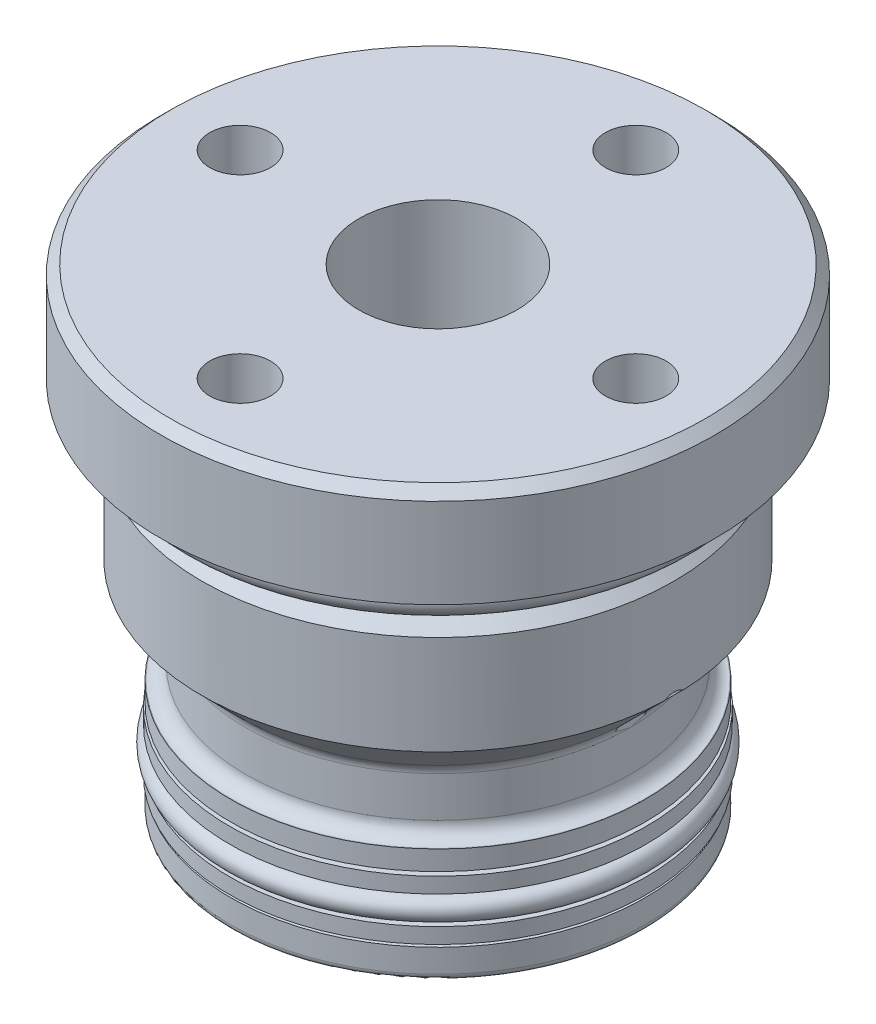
from build123d import *

# Parameters (mm, degrees)
FILLET1_R               = 1.143
FILLET2_R               = 0.381
FILLET3_R               = 0.508
CIRPATTERN1_COUNT       = 4
CHAMFER1_SIZE           = 0.762000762
FILLET4_R               = 0.381
SKETCH5_R               = 1.3081
SKETCH6_R               = 0.889
SKETCH6_W               = 1.3462
SKETCH6_H               = 1.2446
CUT_EXTRUDE1_DEPTH      = 50.391408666
CUT_EXTRUDE1_DEPTH_BACK = 50.391408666
SKETCH7_R               = 1.1811
CUT_EXTRUDE3_START      = 15.4305
CUT_EXTRUDE3_DEPTH      = 27.686


with BuildPart() as part:
    # Sketch1 → Revolve1 (revolve)
    with BuildSketch(Plane.XY, mode=Mode.PRIVATE) as revolve1_sk:
        Polygon((-12.7, 0), (-12.7, 18.2372), (-6.35, 18.2372), (-6.35, 38.1), (-22.225, 38.1), (-22.225, 30.1498), (-18.9611, 30.1498), (-18.9611, 17.6149), (-15.4305, 14.0843), (-15.4305, 9.2202), (-16.6243, 9.2202), (-16.6243, 7.6454), (-15.367, 7.6454), (-15.367, 2.3876), (-16.6243, 2.3876), (-16.6243, 0), align=None)
    revolve(revolve1_sk.sketch.rotate(Axis((0, 0, 0), (0, 1, 0)), 270), axis=Axis((0, 0, 0), (0, 1, 0)))

    # Fillet1
    fillet1_edges = [part.edges().sort_by_distance(p)[0] for p in [
        (0, 9.2202, 15.4305),
        (0, 14.0843, 15.4305),
    ]]
    fillet(fillet1_edges, radius=FILLET1_R)

    # Fillet2
    fillet2_edges = [part.edges().sort_by_distance(p)[0] for p in [
        (0, 2.3876, 15.367),
        (0, 7.6454, 15.367),
    ]]
    fillet(fillet2_edges, radius=FILLET2_R)

    # Fillet3
    fillet3_edges = [part.edges().sort_by_distance(p)[0] for p in [
        (0, 0, 16.6243),
    ]]
    fillet(fillet3_edges, radius=FILLET3_R)

    # Sketch2 → Hole1 (revolve, cut)
    with BuildSketch(Plane(origin=(15.875, 38.1, 0), x_dir=(0, 0, 1), z_dir=(1, 0, 0))):
        Polygon((0, 0), (0, 6.214938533), (2.4384, 4.7498), (2.4384, 0), align=None)
    hole1 = revolve(axis=Axis((15.875, 42.344199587, 0), (0, -1, 0)), mode=Mode.SUBTRACT)

    # CirPattern1: Hole1 ×4 about axis
    cirpattern1_axis = Axis((0, 0, 0), (0, 1, 0))
    for i in range(1, CIRPATTERN1_COUNT):
        add(hole1.rotate(cirpattern1_axis, i * 360 / CIRPATTERN1_COUNT), mode=Mode.SUBTRACT)

    # Chamfer1
    chamfer1_edges = [part.edges().sort_by_distance(p)[0] for p in [
        (0, 38.1, 22.225),
    ]]
    chamfer(chamfer1_edges, length=CHAMFER1_SIZE)

    # Sketch4 → Cut-Revolve1 (revolve, cut)
    with BuildSketch(Plane.XY, mode=Mode.PRIVATE) as cut_revolve1_sk:
        Polygon((-18.9611, 30.1498), (-18.9611, 25.5651), (-17.8308, 26.6954), (-17.8308, 30.1498), align=None)
    revolve(cut_revolve1_sk.sketch.rotate(Axis((0, 0, 0), (0, 1, 0)), 270), axis=Axis((0, 0, 0), (0, 1, 0)), mode=Mode.SUBTRACT)

    # Fillet4
    fillet4_edges = [part.edges().sort_by_distance(p)[0] for p in [
        (0, 30.1498, 17.8308),
        (0, 26.6954, 17.8308),
    ]]
    fillet(fillet4_edges, radius=FILLET4_R)

    # Sketch5 → Revolve2 (revolve)
    with BuildSketch(Plane.XY, mode=Mode.PRIVATE) as revolve2_sk:
        with Locations((-19.1008, 28.8036)):
            Circle(SKETCH5_R)
    revolve(revolve2_sk.sketch.rotate(Axis((0, 0, 0), (0, 1, 0)), 270), axis=Axis((0, 0, 0), (0, 1, 0)))

    # Sketch6 → Revolve3 (revolve)
    with BuildSketch(Plane.XY, mode=Mode.PRIVATE) as revolve3_sk:
        with Locations((-16.2052, 4.9276)):
            Circle(SKETCH6_R)
        with Locations((-16.0401, 6.7691)):
            Rectangle(SKETCH6_W, SKETCH6_H)
        with Locations((-16.0401, 3.2639)):
            Rectangle(SKETCH6_W, SKETCH6_H)
    revolve(revolve3_sk.sketch.rotate(Axis((0, 0, 0), (0, 1, 0)), 270), axis=Axis((0, 0, 0), (0, 1, 0)))

    # Sketch7 → Cut-Extrude1 (cut, two sides: drawn at the far end of the back side and taken through both)
    with BuildSketch(Plane(origin=(0, 0, 0), x_dir=(0, 0, -1), z_dir=(1, 0, 0)).offset(-CUT_EXTRUDE1_DEPTH_BACK)):
        with Locations((0, 16.6878)):
            Circle(SKETCH7_R)
    extrude(amount=CUT_EXTRUDE1_DEPTH + CUT_EXTRUDE1_DEPTH_BACK, mode=Mode.SUBTRACT)

    # Sketch8 → Cut-Extrude3 (cut)
    with BuildSketch(Plane(origin=(0, 0, 0), x_dir=(0, 0, -1), z_dir=(1, 0, 0)).offset(CUT_EXTRUDE3_START)):
        with BuildLine():
            Line((-1.1811, 16.6878), (-1.1811, 11.9253))
            ThreePointArc((-1.1811, 11.9253), (0, 10.7442), (1.1811, 11.9253))
            Line((1.1811, 11.9253), (1.1811, 16.6878))
            ThreePointArc((1.1811, 16.6878), (0, 17.8689), (-1.1811, 16.6878))
        make_face()
    cut_extrude3 = extrude(amount=CUT_EXTRUDE3_DEPTH, mode=Mode.SUBTRACT)

    # Mirror1: Cut-Extrude3 across plane
    add(cut_extrude3.mirror(Plane(origin=(0, 0, 0), x_dir=(0, 0, 1), z_dir=(1, 0, 0))), mode=Mode.SUBTRACT)


solid = part.part
